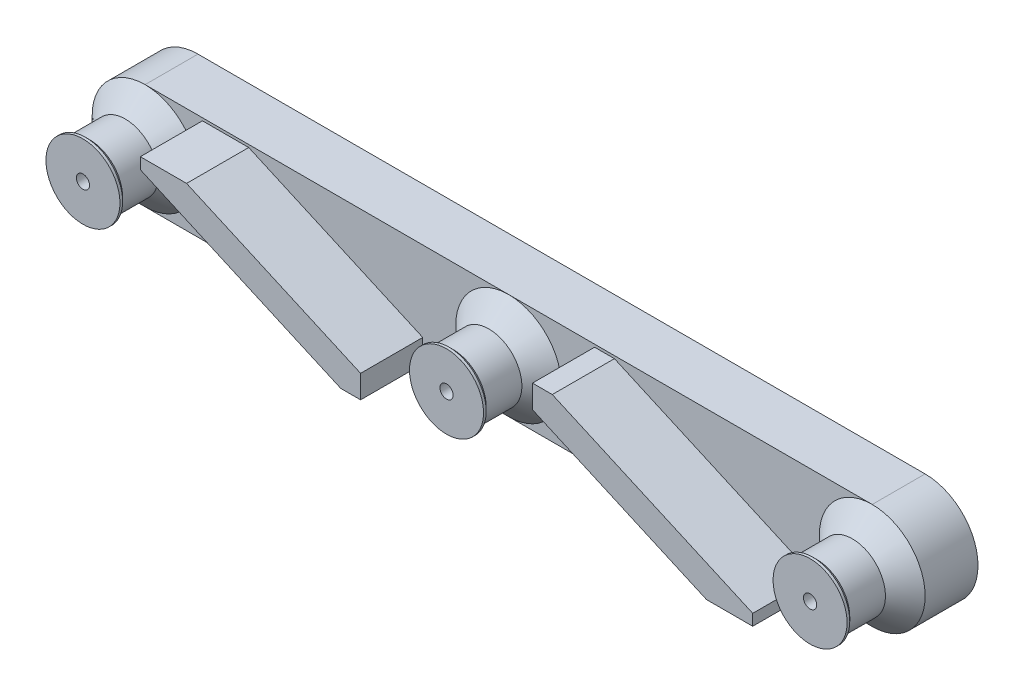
ISO-10303-21;
HEADER;
FILE_DESCRIPTION(('STEP AP214'),'2;1');
FILE_NAME('part.step','',(''),(''),'','','');
FILE_SCHEMA(('AUTOMOTIVE_DESIGN { 1 0 10303 214 1 1 1 1 }'));
ENDSEC;
DATA;
#1=APPLICATION_CONTEXT('core data for automotive mechanical design processes');
#2=APPLICATION_PROTOCOL_DEFINITION('international standard','automotive_design',2000,#1);
#3=PRODUCT_CONTEXT('',#1,'mechanical');
#4=PRODUCT('Part','Part','',(#3));
#5=PRODUCT_RELATED_PRODUCT_CATEGORY('part','',(#4));
#6=PRODUCT_DEFINITION_FORMATION('','',#4);
#7=PRODUCT_DEFINITION_CONTEXT('part definition',#1,'design');
#8=PRODUCT_DEFINITION('design','',#6,#7);
#9=PRODUCT_DEFINITION_SHAPE('','',#8);
#10=(LENGTH_UNIT() NAMED_UNIT(*) SI_UNIT(.MILLI.,.METRE.));
#11=(NAMED_UNIT(*) PLANE_ANGLE_UNIT() SI_UNIT($,.RADIAN.));
#12=(NAMED_UNIT(*) SI_UNIT($,.STERADIAN.) SOLID_ANGLE_UNIT());
#13=UNCERTAINTY_MEASURE_WITH_UNIT(LENGTH_MEASURE(1.E-05),#10,'distance_accuracy_value','');
#14=(GEOMETRIC_REPRESENTATION_CONTEXT(3) GLOBAL_UNCERTAINTY_ASSIGNED_CONTEXT((#13)) GLOBAL_UNIT_ASSIGNED_CONTEXT((#10,
#11,#12)) REPRESENTATION_CONTEXT('',''));
#15=CARTESIAN_POINT('',(0.,0.,0.));
#16=DIRECTION('',(0.,0.,1.));
#17=DIRECTION('',(1.,0.,0.));
#18=AXIS2_PLACEMENT_3D('',#15,#16,#17);
#19=CARTESIAN_POINT('',(-27.5,0.,4.));
#20=DIRECTION('',(0.,0.,1.));
#21=DIRECTION('',(1.,0.,0.));
#22=AXIS2_PLACEMENT_3D('',#19,#20,#21);
#23=PLANE('',#22);
#24=DIRECTION('',(1.,0.,0.));
#25=VECTOR('',#24,1.);
#26=CARTESIAN_POINT('',(19.6609741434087,-3.8,4.));
#27=LINE('',#26,#25);
#28=CARTESIAN_POINT('',(19.6609741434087,-3.8,4.));
#29=VERTEX_POINT('',#28);
#30=CARTESIAN_POINT('',(23.1609741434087,-3.8,4.));
#31=VERTEX_POINT('',#30);
#32=EDGE_CURVE('E228',#29,#31,#27,.T.);
#33=ORIENTED_EDGE('',*,*,#32,.F.);
#34=DIRECTION('',(0.9135454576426,-0.406736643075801,0.));
#35=VECTOR('',#34,1.);
#36=CARTESIAN_POINT('',(6.5,2.0596432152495,4.));
#37=LINE('',#36,#35);
#38=CARTESIAN_POINT('',(6.5,2.0596432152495,4.));
#39=VERTEX_POINT('',#38);
#40=EDGE_CURVE('E65',#39,#29,#37,.T.);
#41=ORIENTED_EDGE('',*,*,#40,.F.);
#42=DIRECTION('',(0.,-1.,0.));
#43=VECTOR('',#42,1.);
#44=CARTESIAN_POINT('',(6.5,3.8,4.));
#45=LINE('',#44,#43);
#46=CARTESIAN_POINT('',(6.5,3.8,4.));
#47=VERTEX_POINT('',#46);
#48=EDGE_CURVE('E70',#47,#39,#45,.T.);
#49=ORIENTED_EDGE('',*,*,#48,.F.);
#50=DIRECTION('',(-1.,0.,0.));
#51=VECTOR('',#50,1.);
#52=CARTESIAN_POINT('',(8.,3.8,4.));
#53=LINE('',#52,#51);
#54=CARTESIAN_POINT('',(8.,3.8,4.));
#55=VERTEX_POINT('',#54);
#56=EDGE_CURVE('E207',#55,#47,#53,.T.);
#57=ORIENTED_EDGE('',*,*,#56,.F.);
#58=DIRECTION('',(-0.9135454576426,0.406736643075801,0.));
#59=VECTOR('',#58,1.);
#60=CARTESIAN_POINT('',(23.1609741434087,-2.95010058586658,4.));
#61=LINE('',#60,#59);
#62=CARTESIAN_POINT('',(23.1609741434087,-2.95010058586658,4.));
#63=VERTEX_POINT('',#62);
#64=EDGE_CURVE('E182',#63,#55,#61,.T.);
#65=ORIENTED_EDGE('',*,*,#64,.F.);
#66=DIRECTION('',(0.,1.,0.));
#67=VECTOR('',#66,1.);
#68=CARTESIAN_POINT('',(23.1609741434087,-3.8,4.));
#69=LINE('',#68,#67);
#70=EDGE_CURVE('E189',#31,#63,#69,.T.);
#71=ORIENTED_EDGE('',*,*,#70,.F.);
#72=EDGE_LOOP('',(#33,#41,#49,#57,#65,#71));
#73=FACE_BOUND('',#72,.T.);
#74=DIRECTION('',(1.,0.,0.));
#75=VECTOR('',#74,1.);
#76=CARTESIAN_POINT('',(-27.5,-4.,4.));
#77=LINE('',#76,#75);
#78=CARTESIAN_POINT('',(0.,-4.,4.));
#79=VERTEX_POINT('',#78);
#80=CARTESIAN_POINT('',(27.5,-4.00000000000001,4.));
#81=VERTEX_POINT('',#80);
#82=EDGE_CURVE('E341',#79,#81,#77,.T.);
#83=ORIENTED_EDGE('',*,*,#82,.T.);
#84=CARTESIAN_POINT('',(27.5,0.,4.));
#85=DIRECTION('',(0.,0.,1.));
#86=DIRECTION('',(1.,0.,0.));
#87=AXIS2_PLACEMENT_3D('',#84,#85,#86);
#88=CIRCLE('',#87,4.);
#89=CARTESIAN_POINT('',(27.5,4.,4.));
#90=VERTEX_POINT('',#89);
#91=EDGE_CURVE('E387',#90,#81,#88,.T.);
#92=ORIENTED_EDGE('',*,*,#91,.F.);
#93=DIRECTION('',(-1.,0.,0.));
#94=VECTOR('',#93,1.);
#95=CARTESIAN_POINT('',(-27.5,4.,4.));
#96=LINE('',#95,#94);
#97=CARTESIAN_POINT('',(0.,4.,4.));
#98=VERTEX_POINT('',#97);
#99=EDGE_CURVE('E342',#90,#98,#96,.T.);
#100=ORIENTED_EDGE('',*,*,#99,.T.);
#101=CARTESIAN_POINT('',(0.,0.,4.));
#102=DIRECTION('',(0.,0.,-1.));
#103=DIRECTION('',(-1.,0.,0.));
#104=AXIS2_PLACEMENT_3D('',#101,#102,#103);
#105=CIRCLE('',#104,4.);
#106=EDGE_CURVE('E314',#98,#79,#105,.T.);
#107=ORIENTED_EDGE('',*,*,#106,.T.);
#108=EDGE_LOOP('',(#83,#92,#100,#107));
#109=FACE_BOUND('',#108,.T.);
#110=ADVANCED_FACE('F46',(#73,#109),#23,.T.);
#111=DIRECTION('',(1.,0.,0.));
#112=VECTOR('',#111,1.);
#113=CARTESIAN_POINT('',(-8.,-3.8,4.));
#114=LINE('',#113,#112);
#115=CARTESIAN_POINT('',(-8.,-3.8,4.));
#116=VERTEX_POINT('',#115);
#117=CARTESIAN_POINT('',(-6.5,-3.8,4.));
#118=VERTEX_POINT('',#117);
#119=EDGE_CURVE('E202',#116,#118,#114,.T.);
#120=ORIENTED_EDGE('',*,*,#119,.F.);
#121=DIRECTION('',(0.9135454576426,-0.406736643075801,0.));
#122=VECTOR('',#121,1.);
#123=CARTESIAN_POINT('',(-23.1609741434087,2.95010058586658,4.));
#124=LINE('',#123,#122);
#125=CARTESIAN_POINT('',(-23.1609741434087,2.95010058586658,4.));
#126=VERTEX_POINT('',#125);
#127=EDGE_CURVE('E234',#126,#116,#124,.T.);
#128=ORIENTED_EDGE('',*,*,#127,.F.);
#129=DIRECTION('',(0.,-1.,0.));
#130=VECTOR('',#129,1.);
#131=CARTESIAN_POINT('',(-23.1609741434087,3.8,4.));
#132=LINE('',#131,#130);
#133=CARTESIAN_POINT('',(-23.1609741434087,3.8,4.));
#134=VERTEX_POINT('',#133);
#135=EDGE_CURVE('E239',#134,#126,#132,.T.);
#136=ORIENTED_EDGE('',*,*,#135,.F.);
#137=DIRECTION('',(-1.,0.,0.));
#138=VECTOR('',#137,1.);
#139=CARTESIAN_POINT('',(-19.6609741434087,3.8,4.));
#140=LINE('',#139,#138);
#141=CARTESIAN_POINT('',(-19.6609741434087,3.8,4.));
#142=VERTEX_POINT('',#141);
#143=EDGE_CURVE('E243',#142,#134,#140,.T.);
#144=ORIENTED_EDGE('',*,*,#143,.F.);
#145=DIRECTION('',(-0.9135454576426,0.406736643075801,0.));
#146=VECTOR('',#145,1.);
#147=CARTESIAN_POINT('',(-6.5,-2.0596432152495,4.));
#148=LINE('',#147,#146);
#149=CARTESIAN_POINT('',(-6.5,-2.0596432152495,4.));
#150=VERTEX_POINT('',#149);
#151=EDGE_CURVE('E248',#150,#142,#148,.T.);
#152=ORIENTED_EDGE('',*,*,#151,.F.);
#153=DIRECTION('',(0.,1.,0.));
#154=VECTOR('',#153,1.);
#155=CARTESIAN_POINT('',(-6.5,-3.8,4.));
#156=LINE('',#155,#154);
#157=EDGE_CURVE('E252',#118,#150,#156,.T.);
#158=ORIENTED_EDGE('',*,*,#157,.F.);
#159=EDGE_LOOP('',(#120,#128,#136,#144,#152,#158));
#160=FACE_BOUND('',#159,.T.);
#161=CARTESIAN_POINT('',(-27.5,-4.,4.));
#162=VERTEX_POINT('',#161);
#163=EDGE_CURVE('E337',#162,#79,#77,.T.);
#164=ORIENTED_EDGE('',*,*,#163,.T.);
#165=CARTESIAN_POINT('',(0.,0.,4.));
#166=DIRECTION('',(0.,0.,1.));
#167=DIRECTION('',(1.,0.,0.));
#168=AXIS2_PLACEMENT_3D('',#165,#166,#167);
#169=CIRCLE('',#168,4.);
#170=EDGE_CURVE('E403',#98,#79,#169,.T.);
#171=ORIENTED_EDGE('',*,*,#170,.F.);
#172=CARTESIAN_POINT('',(-27.5,4.,4.));
#173=VERTEX_POINT('',#172);
#174=EDGE_CURVE('E340',#98,#173,#96,.T.);
#175=ORIENTED_EDGE('',*,*,#174,.T.);
#176=CARTESIAN_POINT('',(-27.5,0.,4.));
#177=DIRECTION('',(0.,0.,1.));
#178=DIRECTION('',(1.,0.,0.));
#179=AXIS2_PLACEMENT_3D('',#176,#177,#178);
#180=CIRCLE('',#179,4.);
#181=EDGE_CURVE('E331',#162,#173,#180,.T.);
#182=ORIENTED_EDGE('',*,*,#181,.F.);
#183=EDGE_LOOP('',(#164,#171,#175,#182));
#184=FACE_BOUND('',#183,.T.);
#185=ADVANCED_FACE('F444',(#160,#184),#23,.T.);
#186=CARTESIAN_POINT('',(-27.5,0.,4.));
#187=DIRECTION('',(0.,0.,-1.));
#188=DIRECTION('',(-1.,0.,0.));
#189=AXIS2_PLACEMENT_3D('',#186,#187,#188);
#190=CYLINDRICAL_SURFACE('',#189,4.);
#191=DIRECTION('',(0.,0.,-1.));
#192=VECTOR('',#191,1.);
#193=CARTESIAN_POINT('',(-27.5,-4.,4.));
#194=LINE('',#193,#192);
#195=CARTESIAN_POINT('',(-27.5,-4.,0.));
#196=VERTEX_POINT('',#195);
#197=EDGE_CURVE('E336',#162,#196,#194,.T.);
#198=ORIENTED_EDGE('',*,*,#197,.F.);
#199=CARTESIAN_POINT('',(-27.5,0.,4.00000000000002));
#200=DIRECTION('',(0.,0.,1.));
#201=DIRECTION('',(1.,0.,0.));
#202=AXIS2_PLACEMENT_3D('',#199,#200,#201);
#203=CIRCLE('',#202,4.);
#204=EDGE_CURVE('E375',#162,#173,#203,.F.);
#205=ORIENTED_EDGE('',*,*,#204,.T.);
#206=DIRECTION('',(0.,0.,-1.));
#207=VECTOR('',#206,1.);
#208=CARTESIAN_POINT('',(-27.5,4.,4.));
#209=LINE('',#208,#207);
#210=CARTESIAN_POINT('',(-27.5,4.,0.));
#211=VERTEX_POINT('',#210);
#212=EDGE_CURVE('E345',#173,#211,#209,.T.);
#213=ORIENTED_EDGE('',*,*,#212,.T.);
#214=CARTESIAN_POINT('',(-27.5,0.,0.));
#215=DIRECTION('',(0.,0.,1.));
#216=DIRECTION('',(1.,0.,0.));
#217=AXIS2_PLACEMENT_3D('',#214,#215,#216);
#218=CIRCLE('',#217,4.);
#219=EDGE_CURVE('E330',#211,#196,#218,.T.);
#220=ORIENTED_EDGE('',*,*,#219,.T.);
#221=EDGE_LOOP('',(#198,#205,#213,#220));
#222=FACE_BOUND('',#221,.T.);
#223=ADVANCED_FACE('F450',(#222),#190,.T.);
#224=CARTESIAN_POINT('',(-27.5,-4.,4.));
#225=DIRECTION('',(0.,1.,0.));
#226=DIRECTION('',(0.,0.,1.));
#227=AXIS2_PLACEMENT_3D('',#224,#225,#226);
#228=PLANE('',#227);
#229=DIRECTION('',(1.,0.,0.));
#230=VECTOR('',#229,1.);
#231=CARTESIAN_POINT('',(-27.5,-4.,0.));
#232=LINE('',#231,#230);
#233=CARTESIAN_POINT('',(27.5,-4.00000000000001,0.));
#234=VERTEX_POINT('',#233);
#235=EDGE_CURVE('E349',#196,#234,#232,.T.);
#236=ORIENTED_EDGE('',*,*,#235,.T.);
#237=DIRECTION('',(0.,0.,-1.));
#238=VECTOR('',#237,1.);
#239=CARTESIAN_POINT('',(27.5,-4.00000000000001,4.));
#240=LINE('',#239,#238);
#241=EDGE_CURVE('E365',#81,#234,#240,.T.);
#242=ORIENTED_EDGE('',*,*,#241,.F.);
#243=ORIENTED_EDGE('',*,*,#82,.F.);
#244=ORIENTED_EDGE('',*,*,#163,.F.);
#245=ORIENTED_EDGE('',*,*,#197,.T.);
#246=EDGE_LOOP('',(#236,#242,#243,#244,#245));
#247=FACE_BOUND('',#246,.T.);
#248=ADVANCED_FACE('F465',(#247),#228,.F.);
#249=CARTESIAN_POINT('',(27.5,0.,4.));
#250=DIRECTION('',(0.,0.,-1.));
#251=DIRECTION('',(-1.,0.,0.));
#252=AXIS2_PLACEMENT_3D('',#249,#250,#251);
#253=CYLINDRICAL_SURFACE('',#252,4.00000000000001);
#254=DIRECTION('',(0.,0.,-1.));
#255=VECTOR('',#254,1.);
#256=CARTESIAN_POINT('',(27.5,4.00000000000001,4.));
#257=LINE('',#256,#255);
#258=CARTESIAN_POINT('',(27.5,4.00000000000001,0.));
#259=VERTEX_POINT('',#258);
#260=EDGE_CURVE('E361',#90,#259,#257,.T.);
#261=ORIENTED_EDGE('',*,*,#260,.F.);
#262=CARTESIAN_POINT('',(27.5,0.,3.99999999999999));
#263=DIRECTION('',(0.,0.,1.));
#264=DIRECTION('',(1.,0.,0.));
#265=AXIS2_PLACEMENT_3D('',#262,#263,#264);
#266=CIRCLE('',#265,4.00000000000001);
#267=EDGE_CURVE('E391',#90,#81,#266,.F.);
#268=ORIENTED_EDGE('',*,*,#267,.T.);
#269=ORIENTED_EDGE('',*,*,#241,.T.);
#270=CARTESIAN_POINT('',(27.5,0.,0.));
#271=DIRECTION('',(0.,0.,1.));
#272=DIRECTION('',(1.,0.,0.));
#273=AXIS2_PLACEMENT_3D('',#270,#271,#272);
#274=CIRCLE('',#273,4.00000000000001);
#275=EDGE_CURVE('E352',#234,#259,#274,.T.);
#276=ORIENTED_EDGE('',*,*,#275,.T.);
#277=EDGE_LOOP('',(#261,#268,#269,#276));
#278=FACE_BOUND('',#277,.T.);
#279=ADVANCED_FACE('F461',(#278),#253,.T.);
#280=CARTESIAN_POINT('',(-27.5,4.,4.));
#281=DIRECTION('',(0.,-1.,0.));
#282=DIRECTION('',(1.,0.,0.));
#283=AXIS2_PLACEMENT_3D('',#280,#281,#282);
#284=PLANE('',#283);
#285=DIRECTION('',(-1.,0.,0.));
#286=VECTOR('',#285,1.);
#287=CARTESIAN_POINT('',(-27.5,4.,0.));
#288=LINE('',#287,#286);
#289=EDGE_CURVE('E355',#259,#211,#288,.T.);
#290=ORIENTED_EDGE('',*,*,#289,.T.);
#291=ORIENTED_EDGE('',*,*,#212,.F.);
#292=ORIENTED_EDGE('',*,*,#174,.F.);
#293=ORIENTED_EDGE('',*,*,#99,.F.);
#294=ORIENTED_EDGE('',*,*,#260,.T.);
#295=EDGE_LOOP('',(#290,#291,#292,#293,#294));
#296=FACE_BOUND('',#295,.T.);
#297=ADVANCED_FACE('F457',(#296),#284,.F.);
#298=CARTESIAN_POINT('',(-27.5,0.,0.));
#299=DIRECTION('',(0.,0.,1.));
#300=DIRECTION('',(1.,0.,0.));
#301=AXIS2_PLACEMENT_3D('',#298,#299,#300);
#302=PLANE('',#301);
#303=CARTESIAN_POINT('',(27.5,0.,0.));
#304=DIRECTION('',(0.,0.,-1.));
#305=DIRECTION('',(-1.,0.,0.));
#306=AXIS2_PLACEMENT_3D('',#303,#304,#305);
#307=CIRCLE('',#306,0.499999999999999);
#308=CARTESIAN_POINT('',(27.,0.,0.));
#309=VERTEX_POINT('',#308);
#310=EDGE_CURVE('E294',#309,#309,#307,.T.);
#311=ORIENTED_EDGE('',*,*,#310,.F.);
#312=EDGE_LOOP('',(#311));
#313=FACE_BOUND('',#312,.T.);
#314=CARTESIAN_POINT('',(0.,0.,0.));
#315=DIRECTION('',(0.,0.,-1.));
#316=DIRECTION('',(-1.,0.,0.));
#317=AXIS2_PLACEMENT_3D('',#314,#315,#316);
#318=CIRCLE('',#317,0.5);
#319=CARTESIAN_POINT('',(-0.5,0.,0.));
#320=VERTEX_POINT('',#319);
#321=EDGE_CURVE('E299',#320,#320,#318,.T.);
#322=ORIENTED_EDGE('',*,*,#321,.F.);
#323=EDGE_LOOP('',(#322));
#324=FACE_BOUND('',#323,.T.);
#325=CARTESIAN_POINT('',(-27.5,0.,0.));
#326=DIRECTION('',(0.,0.,-1.));
#327=DIRECTION('',(-1.,0.,0.));
#328=AXIS2_PLACEMENT_3D('',#325,#326,#327);
#329=CIRCLE('',#328,0.499999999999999);
#330=CARTESIAN_POINT('',(-28.,0.,0.));
#331=VERTEX_POINT('',#330);
#332=EDGE_CURVE('E264',#331,#331,#329,.T.);
#333=ORIENTED_EDGE('',*,*,#332,.F.);
#334=EDGE_LOOP('',(#333));
#335=FACE_BOUND('',#334,.T.);
#336=ORIENTED_EDGE('',*,*,#219,.F.);
#337=ORIENTED_EDGE('',*,*,#289,.F.);
#338=ORIENTED_EDGE('',*,*,#275,.F.);
#339=ORIENTED_EDGE('',*,*,#235,.F.);
#340=EDGE_LOOP('',(#336,#337,#338,#339));
#341=FACE_BOUND('',#340,.T.);
#342=ADVANCED_FACE('F454',(#313,#324,#335,#341),#302,.F.);
#343=CARTESIAN_POINT('',(-27.5,0.,5.5));
#344=DIRECTION('',(0.,0.,-1.));
#345=DIRECTION('',(-1.,0.,0.));
#346=AXIS2_PLACEMENT_3D('',#343,#344,#345);
#347=CONICAL_SURFACE('',#346,2.50000000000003,0.785398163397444);
#348=ORIENTED_EDGE('',*,*,#181,.T.);
#349=ORIENTED_EDGE('',*,*,#204,.F.);
#350=EDGE_LOOP('',(#348,#349));
#351=FACE_BOUND('',#350,.T.);
#352=CARTESIAN_POINT('',(-27.5,0.,5.5));
#353=DIRECTION('',(0.,0.,1.));
#354=DIRECTION('',(1.,0.,0.));
#355=AXIS2_PLACEMENT_3D('',#352,#353,#354);
#356=CIRCLE('',#355,2.50000000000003);
#357=CARTESIAN_POINT('',(-25.,0.,5.5));
#358=VERTEX_POINT('',#357);
#359=EDGE_CURVE('E335',#358,#358,#356,.T.);
#360=ORIENTED_EDGE('',*,*,#359,.F.);
#361=EDGE_LOOP('',(#360));
#362=FACE_BOUND('',#361,.T.);
#363=ADVANCED_FACE('F440',(#351,#362),#347,.T.);
#364=CARTESIAN_POINT('',(-27.5,0.,7.5));
#365=DIRECTION('',(0.,0.,-1.));
#366=DIRECTION('',(-1.,0.,0.));
#367=AXIS2_PLACEMENT_3D('',#364,#365,#366);
#368=CYLINDRICAL_SURFACE('',#367,2.50000000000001);
#369=CARTESIAN_POINT('',(-27.5,0.,8.20000000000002));
#370=DIRECTION('',(0.,0.,1.));
#371=DIRECTION('',(1.,0.,0.));
#372=AXIS2_PLACEMENT_3D('',#369,#370,#371);
#373=CIRCLE('',#372,2.50000000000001);
#374=CARTESIAN_POINT('',(-25.,0.,8.20000000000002));
#375=VERTEX_POINT('',#374);
#376=EDGE_CURVE('E383',#375,#375,#373,.F.);
#377=ORIENTED_EDGE('',*,*,#376,.T.);
#378=EDGE_LOOP('',(#377));
#379=FACE_BOUND('',#378,.T.);
#380=ORIENTED_EDGE('',*,*,#359,.T.);
#381=EDGE_LOOP('',(#380));
#382=FACE_BOUND('',#381,.T.);
#383=ADVANCED_FACE('F433',(#379,#382),#368,.T.);
#384=CARTESIAN_POINT('',(-27.5,0.,8.7));
#385=DIRECTION('',(0.,0.,-1.));
#386=DIRECTION('',(-1.,0.,0.));
#387=AXIS2_PLACEMENT_3D('',#384,#385,#386);
#388=CYLINDRICAL_SURFACE('',#387,2.8);
#389=CARTESIAN_POINT('',(-27.5,0.,8.50000000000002));
#390=DIRECTION('',(0.,0.,1.));
#391=DIRECTION('',(1.,0.,0.));
#392=AXIS2_PLACEMENT_3D('',#389,#390,#391);
#393=CIRCLE('',#392,2.8);
#394=CARTESIAN_POINT('',(-24.7,0.,8.50000000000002));
#395=VERTEX_POINT('',#394);
#396=EDGE_CURVE('E379',#395,#395,#393,.T.);
#397=ORIENTED_EDGE('',*,*,#396,.T.);
#398=EDGE_LOOP('',(#397));
#399=FACE_BOUND('',#398,.T.);
#400=CARTESIAN_POINT('',(-27.5,0.,8.7));
#401=DIRECTION('',(0.,0.,1.));
#402=DIRECTION('',(1.,0.,0.));
#403=AXIS2_PLACEMENT_3D('',#400,#401,#402);
#404=CIRCLE('',#403,2.8);
#405=CARTESIAN_POINT('',(-24.7,0.,8.7));
#406=VERTEX_POINT('',#405);
#407=EDGE_CURVE('E326',#406,#406,#404,.T.);
#408=ORIENTED_EDGE('',*,*,#407,.F.);
#409=EDGE_LOOP('',(#408));
#410=FACE_BOUND('',#409,.T.);
#411=ADVANCED_FACE('F428',(#399,#410),#388,.T.);
#412=CARTESIAN_POINT('',(-27.5,0.,8.7));
#413=DIRECTION('',(0.,0.,1.));
#414=DIRECTION('',(1.,0.,0.));
#415=AXIS2_PLACEMENT_3D('',#412,#413,#414);
#416=PLANE('',#415);
#417=CARTESIAN_POINT('',(-27.5,0.,8.7));
#418=DIRECTION('',(0.,0.,1.));
#419=DIRECTION('',(1.,0.,0.));
#420=AXIS2_PLACEMENT_3D('',#417,#418,#419);
#421=CIRCLE('',#420,0.499999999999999);
#422=CARTESIAN_POINT('',(-27.,0.,8.7));
#423=VERTEX_POINT('',#422);
#424=EDGE_CURVE('E51',#423,#423,#421,.T.);
#425=ORIENTED_EDGE('',*,*,#424,.F.);
#426=EDGE_LOOP('',(#425));
#427=FACE_BOUND('',#426,.T.);
#428=ORIENTED_EDGE('',*,*,#407,.T.);
#429=EDGE_LOOP('',(#428));
#430=FACE_BOUND('',#429,.T.);
#431=ADVANCED_FACE('F424',(#427,#430),#416,.T.);
#432=CARTESIAN_POINT('',(-27.5,0.,8.50000000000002));
#433=DIRECTION('',(0.,0.,1.));
#434=DIRECTION('',(1.,0.,0.));
#435=AXIS2_PLACEMENT_3D('',#432,#433,#434);
#436=CONICAL_SURFACE('',#435,2.8,0.785398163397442);
#437=ORIENTED_EDGE('',*,*,#376,.F.);
#438=EDGE_LOOP('',(#437));
#439=FACE_BOUND('',#438,.T.);
#440=ORIENTED_EDGE('',*,*,#396,.F.);
#441=EDGE_LOOP('',(#440));
#442=FACE_BOUND('',#441,.T.);
#443=ADVANCED_FACE('F427',(#439,#442),#436,.T.);
#444=CARTESIAN_POINT('',(27.5,0.,7.5));
#445=DIRECTION('',(0.,0.,-1.));
#446=DIRECTION('',(-1.,0.,0.));
#447=AXIS2_PLACEMENT_3D('',#444,#445,#446);
#448=CYLINDRICAL_SURFACE('',#447,2.50000000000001);
#449=CARTESIAN_POINT('',(27.5,0.,8.20000000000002));
#450=DIRECTION('',(0.,0.,1.));
#451=DIRECTION('',(1.,0.,0.));
#452=AXIS2_PLACEMENT_3D('',#449,#450,#451);
#453=CIRCLE('',#452,2.50000000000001);
#454=CARTESIAN_POINT('',(30.,0.,8.20000000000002));
#455=VERTEX_POINT('',#454);
#456=EDGE_CURVE('E399',#455,#455,#453,.F.);
#457=ORIENTED_EDGE('',*,*,#456,.T.);
#458=EDGE_LOOP('',(#457));
#459=FACE_BOUND('',#458,.T.);
#460=CARTESIAN_POINT('',(27.5,0.,5.5));
#461=DIRECTION('',(0.,0.,-1.));
#462=DIRECTION('',(-1.,0.,0.));
#463=AXIS2_PLACEMENT_3D('',#460,#461,#462);
#464=CIRCLE('',#463,2.50000000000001);
#465=CARTESIAN_POINT('',(25.,0.,5.5));
#466=VERTEX_POINT('',#465);
#467=EDGE_CURVE('E322',#466,#466,#464,.T.);
#468=ORIENTED_EDGE('',*,*,#467,.F.);
#469=EDGE_LOOP('',(#468));
#470=FACE_BOUND('',#469,.T.);
#471=ADVANCED_FACE('F484',(#459,#470),#448,.T.);
#472=CARTESIAN_POINT('',(27.5,0.,8.7));
#473=DIRECTION('',(0.,0.,-1.));
#474=DIRECTION('',(-1.,0.,0.));
#475=AXIS2_PLACEMENT_3D('',#472,#473,#474);
#476=CYLINDRICAL_SURFACE('',#475,2.8);
#477=CARTESIAN_POINT('',(27.5,0.,8.50000000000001));
#478=DIRECTION('',(0.,0.,1.));
#479=DIRECTION('',(1.,0.,0.));
#480=AXIS2_PLACEMENT_3D('',#477,#478,#479);
#481=CIRCLE('',#480,2.8);
#482=CARTESIAN_POINT('',(30.3,0.,8.50000000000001));
#483=VERTEX_POINT('',#482);
#484=EDGE_CURVE('E395',#483,#483,#481,.T.);
#485=ORIENTED_EDGE('',*,*,#484,.T.);
#486=EDGE_LOOP('',(#485));
#487=FACE_BOUND('',#486,.T.);
#488=CARTESIAN_POINT('',(27.5,0.,8.7));
#489=DIRECTION('',(0.,0.,-1.));
#490=DIRECTION('',(-1.,0.,0.));
#491=AXIS2_PLACEMENT_3D('',#488,#489,#490);
#492=CIRCLE('',#491,2.8);
#493=CARTESIAN_POINT('',(24.7,0.,8.7));
#494=VERTEX_POINT('',#493);
#495=EDGE_CURVE('E318',#494,#494,#492,.T.);
#496=ORIENTED_EDGE('',*,*,#495,.T.);
#497=EDGE_LOOP('',(#496));
#498=FACE_BOUND('',#497,.T.);
#499=ADVANCED_FACE('F556',(#487,#498),#476,.T.);
#500=CARTESIAN_POINT('',(27.5,0.,8.7));
#501=DIRECTION('',(0.,0.,1.));
#502=DIRECTION('',(-1.,0.,0.));
#503=AXIS2_PLACEMENT_3D('',#500,#501,#502);
#504=PLANE('',#503);
#505=CARTESIAN_POINT('',(27.5,0.,8.7));
#506=DIRECTION('',(0.,0.,1.));
#507=DIRECTION('',(1.,0.,0.));
#508=AXIS2_PLACEMENT_3D('',#505,#506,#507);
#509=CIRCLE('',#508,0.499999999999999);
#510=CARTESIAN_POINT('',(28.,0.,8.7));
#511=VERTEX_POINT('',#510);
#512=EDGE_CURVE('E412',#511,#511,#509,.T.);
#513=ORIENTED_EDGE('',*,*,#512,.F.);
#514=EDGE_LOOP('',(#513));
#515=FACE_BOUND('',#514,.T.);
#516=ORIENTED_EDGE('',*,*,#495,.F.);
#517=EDGE_LOOP('',(#516));
#518=FACE_BOUND('',#517,.T.);
#519=ADVANCED_FACE('F493',(#515,#518),#504,.T.);
#520=CARTESIAN_POINT('',(27.5,0.,3.99999999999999));
#521=DIRECTION('',(0.,0.,-1.));
#522=DIRECTION('',(-1.,0.,0.));
#523=AXIS2_PLACEMENT_3D('',#520,#521,#522);
#524=CONICAL_SURFACE('',#523,4.00000000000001,0.785398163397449);
#525=ORIENTED_EDGE('',*,*,#467,.T.);
#526=EDGE_LOOP('',(#525));
#527=FACE_BOUND('',#526,.T.);
#528=ORIENTED_EDGE('',*,*,#91,.T.);
#529=ORIENTED_EDGE('',*,*,#267,.F.);
#530=EDGE_LOOP('',(#528,#529));
#531=FACE_BOUND('',#530,.T.);
#532=ADVANCED_FACE('F486',(#527,#531),#524,.T.);
#533=CARTESIAN_POINT('',(27.5,0.,7.5));
#534=DIRECTION('',(0.,0.,1.));
#535=DIRECTION('',(1.,0.,0.));
#536=AXIS2_PLACEMENT_3D('',#533,#534,#535);
#537=CONICAL_SURFACE('',#536,1.79999999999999,0.785398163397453);
#538=ORIENTED_EDGE('',*,*,#484,.F.);
#539=EDGE_LOOP('',(#538));
#540=FACE_BOUND('',#539,.T.);
#541=ORIENTED_EDGE('',*,*,#456,.F.);
#542=EDGE_LOOP('',(#541));
#543=FACE_BOUND('',#542,.T.);
#544=ADVANCED_FACE('F492',(#540,#543),#537,.T.);
#545=CARTESIAN_POINT('',(0.,0.,7.5));
#546=DIRECTION('',(0.,0.,-1.));
#547=DIRECTION('',(-1.,0.,0.));
#548=AXIS2_PLACEMENT_3D('',#545,#546,#547);
#549=CYLINDRICAL_SURFACE('',#548,2.50000000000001);
#550=CARTESIAN_POINT('',(0.,0.,8.20000000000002));
#551=DIRECTION('',(0.,0.,1.));
#552=DIRECTION('',(1.,0.,0.));
#553=AXIS2_PLACEMENT_3D('',#550,#551,#552);
#554=CIRCLE('',#553,2.50000000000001);
#555=CARTESIAN_POINT('',(2.50000000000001,0.,8.20000000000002));
#556=VERTEX_POINT('',#555);
#557=EDGE_CURVE('E11',#556,#556,#554,.F.);
#558=ORIENTED_EDGE('',*,*,#557,.T.);
#559=EDGE_LOOP('',(#558));
#560=FACE_BOUND('',#559,.T.);
#561=CARTESIAN_POINT('',(0.,0.,5.5));
#562=DIRECTION('',(0.,0.,-1.));
#563=DIRECTION('',(-1.,0.,0.));
#564=AXIS2_PLACEMENT_3D('',#561,#562,#563);
#565=CIRCLE('',#564,2.50000000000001);
#566=CARTESIAN_POINT('',(-2.50000000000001,0.,5.5));
#567=VERTEX_POINT('',#566);
#568=EDGE_CURVE('E310',#567,#567,#565,.T.);
#569=ORIENTED_EDGE('',*,*,#568,.F.);
#570=EDGE_LOOP('',(#569));
#571=FACE_BOUND('',#570,.T.);
#572=ADVANCED_FACE('F499',(#560,#571),#549,.T.);
#573=CARTESIAN_POINT('',(0.,0.,8.7));
#574=DIRECTION('',(0.,0.,-1.));
#575=DIRECTION('',(-1.,0.,0.));
#576=AXIS2_PLACEMENT_3D('',#573,#574,#575);
#577=CYLINDRICAL_SURFACE('',#576,2.8);
#578=CARTESIAN_POINT('',(0.,0.,8.50000000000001));
#579=DIRECTION('',(0.,0.,1.));
#580=DIRECTION('',(1.,0.,0.));
#581=AXIS2_PLACEMENT_3D('',#578,#579,#580);
#582=CIRCLE('',#581,2.8);
#583=CARTESIAN_POINT('',(2.8,0.,8.50000000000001));
#584=VERTEX_POINT('',#583);
#585=EDGE_CURVE('E57',#584,#584,#582,.T.);
#586=ORIENTED_EDGE('',*,*,#585,.T.);
#587=EDGE_LOOP('',(#586));
#588=FACE_BOUND('',#587,.T.);
#589=CARTESIAN_POINT('',(0.,0.,8.7));
#590=DIRECTION('',(0.,0.,-1.));
#591=DIRECTION('',(-1.,0.,0.));
#592=AXIS2_PLACEMENT_3D('',#589,#590,#591);
#593=CIRCLE('',#592,2.8);
#594=CARTESIAN_POINT('',(-2.8,0.,8.7));
#595=VERTEX_POINT('',#594);
#596=EDGE_CURVE('E306',#595,#595,#593,.T.);
#597=ORIENTED_EDGE('',*,*,#596,.T.);
#598=EDGE_LOOP('',(#597));
#599=FACE_BOUND('',#598,.T.);
#600=ADVANCED_FACE('F514',(#588,#599),#577,.T.);
#601=CARTESIAN_POINT('',(0.,0.,8.7));
#602=DIRECTION('',(0.,0.,1.));
#603=DIRECTION('',(-1.,0.,0.));
#604=AXIS2_PLACEMENT_3D('',#601,#602,#603);
#605=PLANE('',#604);
#606=CARTESIAN_POINT('',(0.,0.,8.7));
#607=DIRECTION('',(0.,0.,1.));
#608=DIRECTION('',(1.,0.,0.));
#609=AXIS2_PLACEMENT_3D('',#606,#607,#608);
#610=CIRCLE('',#609,0.5);
#611=CARTESIAN_POINT('',(0.5,0.,8.7));
#612=VERTEX_POINT('',#611);
#613=EDGE_CURVE('E298',#612,#612,#610,.T.);
#614=ORIENTED_EDGE('',*,*,#613,.F.);
#615=EDGE_LOOP('',(#614));
#616=FACE_BOUND('',#615,.T.);
#617=ORIENTED_EDGE('',*,*,#596,.F.);
#618=EDGE_LOOP('',(#617));
#619=FACE_BOUND('',#618,.T.);
#620=ADVANCED_FACE('F505',(#616,#619),#605,.T.);
#621=CARTESIAN_POINT('',(0.,0.,7.5));
#622=DIRECTION('',(0.,0.,1.));
#623=DIRECTION('',(1.,0.,0.));
#624=AXIS2_PLACEMENT_3D('',#621,#622,#623);
#625=CONICAL_SURFACE('',#624,1.79999999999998,0.785398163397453);
#626=ORIENTED_EDGE('',*,*,#585,.F.);
#627=EDGE_LOOP('',(#626));
#628=FACE_BOUND('',#627,.T.);
#629=ORIENTED_EDGE('',*,*,#557,.F.);
#630=EDGE_LOOP('',(#629));
#631=FACE_BOUND('',#630,.T.);
#632=ADVANCED_FACE('F501',(#628,#631),#625,.T.);
#633=CARTESIAN_POINT('',(0.,0.,4.00000000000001));
#634=DIRECTION('',(0.,0.,-1.));
#635=DIRECTION('',(-1.,0.,0.));
#636=AXIS2_PLACEMENT_3D('',#633,#634,#635);
#637=CONICAL_SURFACE('',#636,4.,0.785398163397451);
#638=ORIENTED_EDGE('',*,*,#568,.T.);
#639=EDGE_LOOP('',(#638));
#640=FACE_BOUND('',#639,.T.);
#641=ORIENTED_EDGE('',*,*,#170,.T.);
#642=ORIENTED_EDGE('',*,*,#106,.F.);
#643=EDGE_LOOP('',(#641,#642));
#644=FACE_BOUND('',#643,.T.);
#645=ADVANCED_FACE('F49',(#640,#644),#637,.T.);
#646=CARTESIAN_POINT('',(0.,0.,9.5));
#647=DIRECTION('',(0.,0.,-1.));
#648=DIRECTION('',(-1.,0.,0.));
#649=AXIS2_PLACEMENT_3D('',#646,#647,#648);
#650=CYLINDRICAL_SURFACE('',#649,0.5);
#651=ORIENTED_EDGE('',*,*,#613,.T.);
#652=EDGE_LOOP('',(#651));
#653=FACE_BOUND('',#652,.T.);
#654=ORIENTED_EDGE('',*,*,#321,.T.);
#655=EDGE_LOOP('',(#654));
#656=FACE_BOUND('',#655,.T.);
#657=ADVANCED_FACE('F511',(#653,#656),#650,.F.);
#658=CARTESIAN_POINT('',(27.5,0.,9.5));
#659=DIRECTION('',(0.,0.,-1.));
#660=DIRECTION('',(-1.,0.,0.));
#661=AXIS2_PLACEMENT_3D('',#658,#659,#660);
#662=CYLINDRICAL_SURFACE('',#661,0.499999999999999);
#663=ORIENTED_EDGE('',*,*,#512,.T.);
#664=EDGE_LOOP('',(#663));
#665=FACE_BOUND('',#664,.T.);
#666=ORIENTED_EDGE('',*,*,#310,.T.);
#667=EDGE_LOOP('',(#666));
#668=FACE_BOUND('',#667,.T.);
#669=ADVANCED_FACE('F622',(#665,#668),#662,.F.);
#670=CARTESIAN_POINT('',(-27.5,0.,9.5));
#671=DIRECTION('',(0.,0.,-1.));
#672=DIRECTION('',(-1.,0.,0.));
#673=AXIS2_PLACEMENT_3D('',#670,#671,#672);
#674=CYLINDRICAL_SURFACE('',#673,0.499999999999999);
#675=ORIENTED_EDGE('',*,*,#424,.T.);
#676=EDGE_LOOP('',(#675));
#677=FACE_BOUND('',#676,.T.);
#678=ORIENTED_EDGE('',*,*,#332,.T.);
#679=EDGE_LOOP('',(#678));
#680=FACE_BOUND('',#679,.T.);
#681=ADVANCED_FACE('F421',(#677,#680),#674,.F.);
#682=CARTESIAN_POINT('',(-8.,-3.8,27.0125110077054));
#683=DIRECTION('',(0.,1.,0.));
#684=DIRECTION('',(0.,0.,1.));
#685=AXIS2_PLACEMENT_3D('',#682,#683,#684);
#686=PLANE('',#685);
#687=DIRECTION('',(1.,0.,0.));
#688=VECTOR('',#687,1.);
#689=CARTESIAN_POINT('',(-8.,-3.8,8.7));
#690=LINE('',#689,#688);
#691=CARTESIAN_POINT('',(-8.,-3.8,8.7));
#692=VERTEX_POINT('',#691);
#693=CARTESIAN_POINT('',(-6.5,-3.8,8.70000000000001));
#694=VERTEX_POINT('',#693);
#695=EDGE_CURVE('E276',#692,#694,#690,.T.);
#696=ORIENTED_EDGE('',*,*,#695,.F.);
#697=DIRECTION('',(0.,0.,-1.));
#698=VECTOR('',#697,1.);
#699=CARTESIAN_POINT('',(-8.,-3.8,27.0125110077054));
#700=LINE('',#699,#698);
#701=EDGE_CURVE('E197',#692,#116,#700,.T.);
#702=ORIENTED_EDGE('',*,*,#701,.T.);
#703=ORIENTED_EDGE('',*,*,#119,.T.);
#704=DIRECTION('',(0.,0.,-1.));
#705=VECTOR('',#704,1.);
#706=CARTESIAN_POINT('',(-6.5,-3.8,27.0125110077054));
#707=LINE('',#706,#705);
#708=EDGE_CURVE('E256',#694,#118,#707,.T.);
#709=ORIENTED_EDGE('',*,*,#708,.F.);
#710=EDGE_LOOP('',(#696,#702,#703,#709));
#711=FACE_BOUND('',#710,.T.);
#712=ADVANCED_FACE('F640',(#711),#686,.F.);
#713=CARTESIAN_POINT('',(-6.5,-3.8,27.0125110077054));
#714=DIRECTION('',(-1.,0.,0.));
#715=DIRECTION('',(0.,0.,1.));
#716=AXIS2_PLACEMENT_3D('',#713,#714,#715);
#717=PLANE('',#716);
#718=DIRECTION('',(0.,1.,0.));
#719=VECTOR('',#718,1.);
#720=CARTESIAN_POINT('',(-6.5,-3.8,8.7));
#721=LINE('',#720,#719);
#722=CARTESIAN_POINT('',(-6.5,-2.0596432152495,8.70000000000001));
#723=VERTEX_POINT('',#722);
#724=EDGE_CURVE('E272',#694,#723,#721,.T.);
#725=ORIENTED_EDGE('',*,*,#724,.F.);
#726=ORIENTED_EDGE('',*,*,#708,.T.);
#727=ORIENTED_EDGE('',*,*,#157,.T.);
#728=DIRECTION('',(0.,0.,-1.));
#729=VECTOR('',#728,1.);
#730=CARTESIAN_POINT('',(-6.5,-2.0596432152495,27.0125110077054));
#731=LINE('',#730,#729);
#732=EDGE_CURVE('E251',#723,#150,#731,.T.);
#733=ORIENTED_EDGE('',*,*,#732,.F.);
#734=EDGE_LOOP('',(#725,#726,#727,#733));
#735=FACE_BOUND('',#734,.T.);
#736=ADVANCED_FACE('F658',(#735),#717,.F.);
#737=CARTESIAN_POINT('',(-6.5,-2.0596432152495,27.0125110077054));
#738=DIRECTION('',(-0.406736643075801,-0.913545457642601,0.));
#739=DIRECTION('',(0.913545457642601,-0.406736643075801,0.));
#740=AXIS2_PLACEMENT_3D('',#737,#738,#739);
#741=PLANE('',#740);
#742=DIRECTION('',(0.,0.,-1.));
#743=VECTOR('',#742,1.);
#744=CARTESIAN_POINT('',(-19.6609741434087,3.8,27.0125110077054));
#745=LINE('',#744,#743);
#746=CARTESIAN_POINT('',(-19.6609741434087,3.8,8.70000000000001));
#747=VERTEX_POINT('',#746);
#748=EDGE_CURVE('E247',#747,#142,#745,.T.);
#749=ORIENTED_EDGE('',*,*,#748,.F.);
#750=DIRECTION('',(-0.913545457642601,0.406736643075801,0.));
#751=VECTOR('',#750,1.);
#752=CARTESIAN_POINT('',(-6.5,-2.0596432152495,8.7));
#753=LINE('',#752,#751);
#754=EDGE_CURVE('E269',#723,#747,#753,.T.);
#755=ORIENTED_EDGE('',*,*,#754,.F.);
#756=ORIENTED_EDGE('',*,*,#732,.T.);
#757=ORIENTED_EDGE('',*,*,#151,.T.);
#758=EDGE_LOOP('',(#749,#755,#756,#757));
#759=FACE_BOUND('',#758,.T.);
#760=ADVANCED_FACE('F668',(#759),#741,.F.);
#761=CARTESIAN_POINT('',(-19.6609741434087,3.8,27.0125110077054));
#762=DIRECTION('',(0.,-1.,0.));
#763=DIRECTION('',(1.,0.,0.));
#764=AXIS2_PLACEMENT_3D('',#761,#762,#763);
#765=PLANE('',#764);
#766=DIRECTION('',(-1.,0.,0.));
#767=VECTOR('',#766,1.);
#768=CARTESIAN_POINT('',(-19.6609741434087,3.8,8.7));
#769=LINE('',#768,#767);
#770=CARTESIAN_POINT('',(-23.1609741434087,3.8,8.70000000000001));
#771=VERTEX_POINT('',#770);
#772=EDGE_CURVE('E265',#747,#771,#769,.T.);
#773=ORIENTED_EDGE('',*,*,#772,.F.);
#774=ORIENTED_EDGE('',*,*,#748,.T.);
#775=ORIENTED_EDGE('',*,*,#143,.T.);
#776=DIRECTION('',(0.,0.,-1.));
#777=VECTOR('',#776,1.);
#778=CARTESIAN_POINT('',(-23.1609741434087,3.8,27.0125110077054));
#779=LINE('',#778,#777);
#780=EDGE_CURVE('E242',#771,#134,#779,.T.);
#781=ORIENTED_EDGE('',*,*,#780,.F.);
#782=EDGE_LOOP('',(#773,#774,#775,#781));
#783=FACE_BOUND('',#782,.T.);
#784=ADVANCED_FACE('F679',(#783),#765,.F.);
#785=CARTESIAN_POINT('',(-23.1609741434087,3.8,27.0125110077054));
#786=DIRECTION('',(1.,0.,0.));
#787=DIRECTION('',(0.,0.,-1.));
#788=AXIS2_PLACEMENT_3D('',#785,#786,#787);
#789=PLANE('',#788);
#790=DIRECTION('',(0.,-1.,0.));
#791=VECTOR('',#790,1.);
#792=CARTESIAN_POINT('',(-23.1609741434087,3.8,8.7));
#793=LINE('',#792,#791);
#794=CARTESIAN_POINT('',(-23.1609741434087,2.95010058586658,8.70000000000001));
#795=VERTEX_POINT('',#794);
#796=EDGE_CURVE('E260',#771,#795,#793,.T.);
#797=ORIENTED_EDGE('',*,*,#796,.F.);
#798=ORIENTED_EDGE('',*,*,#780,.T.);
#799=ORIENTED_EDGE('',*,*,#135,.T.);
#800=DIRECTION('',(0.,0.,-1.));
#801=VECTOR('',#800,1.);
#802=CARTESIAN_POINT('',(-23.1609741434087,2.95010058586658,27.0125110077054));
#803=LINE('',#802,#801);
#804=EDGE_CURVE('E238',#795,#126,#803,.T.);
#805=ORIENTED_EDGE('',*,*,#804,.F.);
#806=EDGE_LOOP('',(#797,#798,#799,#805));
#807=FACE_BOUND('',#806,.T.);
#808=ADVANCED_FACE('F690',(#807),#789,.F.);
#809=CARTESIAN_POINT('',(-23.1609741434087,2.95010058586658,27.0125110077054));
#810=DIRECTION('',(0.406736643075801,0.9135454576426,0.));
#811=DIRECTION('',(-0.9135454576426,0.406736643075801,0.));
#812=AXIS2_PLACEMENT_3D('',#809,#810,#811);
#813=PLANE('',#812);
#814=ORIENTED_EDGE('',*,*,#127,.T.);
#815=ORIENTED_EDGE('',*,*,#701,.F.);
#816=DIRECTION('',(0.9135454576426,-0.406736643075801,0.));
#817=VECTOR('',#816,1.);
#818=CARTESIAN_POINT('',(-23.1609741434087,2.95010058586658,8.7));
#819=LINE('',#818,#817);
#820=EDGE_CURVE('E237',#795,#692,#819,.T.);
#821=ORIENTED_EDGE('',*,*,#820,.F.);
#822=ORIENTED_EDGE('',*,*,#804,.T.);
#823=EDGE_LOOP('',(#814,#815,#821,#822));
#824=FACE_BOUND('',#823,.T.);
#825=ADVANCED_FACE('F700',(#824),#813,.F.);
#826=CARTESIAN_POINT('',(-27.5,0.,8.7));
#827=DIRECTION('',(0.,0.,1.));
#828=DIRECTION('',(1.,0.,0.));
#829=AXIS2_PLACEMENT_3D('',#826,#827,#828);
#830=PLANE('',#829);
#831=ORIENTED_EDGE('',*,*,#820,.T.);
#832=ORIENTED_EDGE('',*,*,#695,.T.);
#833=ORIENTED_EDGE('',*,*,#724,.T.);
#834=ORIENTED_EDGE('',*,*,#754,.T.);
#835=ORIENTED_EDGE('',*,*,#772,.T.);
#836=ORIENTED_EDGE('',*,*,#796,.T.);
#837=EDGE_LOOP('',(#831,#832,#833,#834,#835,#836));
#838=FACE_BOUND('',#837,.T.);
#839=ADVANCED_FACE('F711',(#838),#830,.T.);
#840=CARTESIAN_POINT('',(27.5,0.,8.7));
#841=DIRECTION('',(0.,0.,1.));
#842=DIRECTION('',(-1.,0.,0.));
#843=AXIS2_PLACEMENT_3D('',#840,#841,#842);
#844=PLANE('',#843);
#845=DIRECTION('',(0.913545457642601,-0.406736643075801,0.));
#846=VECTOR('',#845,1.);
#847=CARTESIAN_POINT('',(6.5,2.0596432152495,8.7));
#848=LINE('',#847,#846);
#849=CARTESIAN_POINT('',(6.5,2.0596432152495,8.70000000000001));
#850=VERTEX_POINT('',#849);
#851=CARTESIAN_POINT('',(19.6609741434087,-3.8,8.70000000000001));
#852=VERTEX_POINT('',#851);
#853=EDGE_CURVE('E204',#850,#852,#848,.T.);
#854=ORIENTED_EDGE('',*,*,#853,.T.);
#855=DIRECTION('',(1.,0.,0.));
#856=VECTOR('',#855,1.);
#857=CARTESIAN_POINT('',(19.6609741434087,-3.8,8.7));
#858=LINE('',#857,#856);
#859=CARTESIAN_POINT('',(23.1609741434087,-3.8,8.70000000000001));
#860=VERTEX_POINT('',#859);
#861=EDGE_CURVE('E195',#852,#860,#858,.T.);
#862=ORIENTED_EDGE('',*,*,#861,.T.);
#863=DIRECTION('',(0.,1.,0.));
#864=VECTOR('',#863,1.);
#865=CARTESIAN_POINT('',(23.1609741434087,-3.8,8.7));
#866=LINE('',#865,#864);
#867=CARTESIAN_POINT('',(23.1609741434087,-2.95010058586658,8.70000000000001));
#868=VERTEX_POINT('',#867);
#869=EDGE_CURVE('E187',#860,#868,#866,.T.);
#870=ORIENTED_EDGE('',*,*,#869,.T.);
#871=DIRECTION('',(-0.9135454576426,0.406736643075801,0.));
#872=VECTOR('',#871,1.);
#873=CARTESIAN_POINT('',(23.1609741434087,-2.95010058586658,8.7));
#874=LINE('',#873,#872);
#875=CARTESIAN_POINT('',(8.,3.8,8.7));
#876=VERTEX_POINT('',#875);
#877=EDGE_CURVE('E169',#868,#876,#874,.T.);
#878=ORIENTED_EDGE('',*,*,#877,.T.);
#879=DIRECTION('',(-1.,0.,0.));
#880=VECTOR('',#879,1.);
#881=CARTESIAN_POINT('',(8.,3.8,8.7));
#882=LINE('',#881,#880);
#883=CARTESIAN_POINT('',(6.5,3.8,8.70000000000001));
#884=VERTEX_POINT('',#883);
#885=EDGE_CURVE('E181',#876,#884,#882,.T.);
#886=ORIENTED_EDGE('',*,*,#885,.T.);
#887=DIRECTION('',(0.,-1.,0.));
#888=VECTOR('',#887,1.);
#889=CARTESIAN_POINT('',(6.5,3.8,8.7));
#890=LINE('',#889,#888);
#891=EDGE_CURVE('E212',#884,#850,#890,.T.);
#892=ORIENTED_EDGE('',*,*,#891,.T.);
#893=EDGE_LOOP('',(#854,#862,#870,#878,#886,#892));
#894=FACE_BOUND('',#893,.T.);
#895=ADVANCED_FACE('F193',(#894),#844,.T.);
#896=CARTESIAN_POINT('',(23.1609741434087,-3.8,27.0125110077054));
#897=DIRECTION('',(-1.,0.,0.));
#898=DIRECTION('',(0.,0.,1.));
#899=AXIS2_PLACEMENT_3D('',#896,#897,#898);
#900=PLANE('',#899);
#901=ORIENTED_EDGE('',*,*,#869,.F.);
#902=DIRECTION('',(0.,0.,-1.));
#903=VECTOR('',#902,1.);
#904=CARTESIAN_POINT('',(23.1609741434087,-3.8,27.0125110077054));
#905=LINE('',#904,#903);
#906=EDGE_CURVE('E229',#860,#31,#905,.T.);
#907=ORIENTED_EDGE('',*,*,#906,.T.);
#908=ORIENTED_EDGE('',*,*,#70,.T.);
#909=DIRECTION('',(0.,0.,-1.));
#910=VECTOR('',#909,1.);
#911=CARTESIAN_POINT('',(23.1609741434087,-2.95010058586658,27.0125110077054));
#912=LINE('',#911,#910);
#913=EDGE_CURVE('E172',#868,#63,#912,.T.);
#914=ORIENTED_EDGE('',*,*,#913,.F.);
#915=EDGE_LOOP('',(#901,#907,#908,#914));
#916=FACE_BOUND('',#915,.T.);
#917=ADVANCED_FACE('F185',(#916),#900,.F.);
#918=CARTESIAN_POINT('',(19.6609741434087,-3.8,27.0125110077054));
#919=DIRECTION('',(0.,1.,0.));
#920=DIRECTION('',(-1.,0.,0.));
#921=AXIS2_PLACEMENT_3D('',#918,#919,#920);
#922=PLANE('',#921);
#923=ORIENTED_EDGE('',*,*,#861,.F.);
#924=DIRECTION('',(0.,0.,-1.));
#925=VECTOR('',#924,1.);
#926=CARTESIAN_POINT('',(19.6609741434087,-3.8,27.0125110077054));
#927=LINE('',#926,#925);
#928=EDGE_CURVE('E224',#852,#29,#927,.T.);
#929=ORIENTED_EDGE('',*,*,#928,.T.);
#930=ORIENTED_EDGE('',*,*,#32,.T.);
#931=ORIENTED_EDGE('',*,*,#906,.F.);
#932=EDGE_LOOP('',(#923,#929,#930,#931));
#933=FACE_BOUND('',#932,.T.);
#934=ADVANCED_FACE('F774',(#933),#922,.F.);
#935=CARTESIAN_POINT('',(6.5,2.0596432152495,27.0125110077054));
#936=DIRECTION('',(0.406736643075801,0.913545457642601,0.));
#937=DIRECTION('',(-0.913545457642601,0.406736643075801,0.));
#938=AXIS2_PLACEMENT_3D('',#935,#936,#937);
#939=PLANE('',#938);
#940=ORIENTED_EDGE('',*,*,#40,.T.);
#941=ORIENTED_EDGE('',*,*,#928,.F.);
#942=ORIENTED_EDGE('',*,*,#853,.F.);
#943=DIRECTION('',(0.,0.,-1.));
#944=VECTOR('',#943,1.);
#945=CARTESIAN_POINT('',(6.5,2.0596432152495,27.0125110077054));
#946=LINE('',#945,#944);
#947=EDGE_CURVE('E221',#850,#39,#946,.T.);
#948=ORIENTED_EDGE('',*,*,#947,.T.);
#949=EDGE_LOOP('',(#940,#941,#942,#948));
#950=FACE_BOUND('',#949,.T.);
#951=ADVANCED_FACE('F764',(#950),#939,.F.);
#952=CARTESIAN_POINT('',(23.1609741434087,-2.95010058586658,27.0125110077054));
#953=DIRECTION('',(-0.406736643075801,-0.9135454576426,0.));
#954=DIRECTION('',(0.9135454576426,-0.406736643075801,0.));
#955=AXIS2_PLACEMENT_3D('',#952,#953,#954);
#956=PLANE('',#955);
#957=DIRECTION('',(0.,0.,-1.));
#958=VECTOR('',#957,1.);
#959=CARTESIAN_POINT('',(8.,3.8,27.0125110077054));
#960=LINE('',#959,#958);
#961=EDGE_CURVE('E175',#876,#55,#960,.T.);
#962=ORIENTED_EDGE('',*,*,#961,.F.);
#963=ORIENTED_EDGE('',*,*,#877,.F.);
#964=ORIENTED_EDGE('',*,*,#913,.T.);
#965=ORIENTED_EDGE('',*,*,#64,.T.);
#966=EDGE_LOOP('',(#962,#963,#964,#965));
#967=FACE_BOUND('',#966,.T.);
#968=ADVANCED_FACE('F171',(#967),#956,.F.);
#969=CARTESIAN_POINT('',(8.,3.8,27.0125110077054));
#970=DIRECTION('',(0.,-1.,0.));
#971=DIRECTION('',(0.,0.,-1.));
#972=AXIS2_PLACEMENT_3D('',#969,#970,#971);
#973=PLANE('',#972);
#974=ORIENTED_EDGE('',*,*,#885,.F.);
#975=ORIENTED_EDGE('',*,*,#961,.T.);
#976=ORIENTED_EDGE('',*,*,#56,.T.);
#977=DIRECTION('',(0.,0.,-1.));
#978=VECTOR('',#977,1.);
#979=CARTESIAN_POINT('',(6.5,3.8,27.0125110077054));
#980=LINE('',#979,#978);
#981=EDGE_CURVE('E218',#884,#47,#980,.T.);
#982=ORIENTED_EDGE('',*,*,#981,.F.);
#983=EDGE_LOOP('',(#974,#975,#976,#982));
#984=FACE_BOUND('',#983,.T.);
#985=ADVANCED_FACE('F743',(#984),#973,.F.);
#986=CARTESIAN_POINT('',(6.5,3.8,27.0125110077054));
#987=DIRECTION('',(1.,0.,0.));
#988=DIRECTION('',(0.,0.,-1.));
#989=AXIS2_PLACEMENT_3D('',#986,#987,#988);
#990=PLANE('',#989);
#991=ORIENTED_EDGE('',*,*,#891,.F.);
#992=ORIENTED_EDGE('',*,*,#981,.T.);
#993=ORIENTED_EDGE('',*,*,#48,.T.);
#994=ORIENTED_EDGE('',*,*,#947,.F.);
#995=EDGE_LOOP('',(#991,#992,#993,#994));
#996=FACE_BOUND('',#995,.T.);
#997=ADVANCED_FACE('F738',(#996),#990,.F.);
#998=CLOSED_SHELL('',(#110,#185,#223,#248,#279,#297,#342,#363,#383,#411,#431,#443,#471,#499,
#519,#532,#544,#572,#600,#620,#632,#645,#657,#669,#681,#712,#736,#760,#784,#808,#825,#839,#895,
#917,#934,#951,#968,#985,#997));
#999=MANIFOLD_SOLID_BREP('B2',#998);
#1000=ADVANCED_BREP_SHAPE_REPRESENTATION('',(#18,#999),#14);
#1001=SHAPE_DEFINITION_REPRESENTATION(#9,#1000);
ENDSEC;
END-ISO-10303-21;
